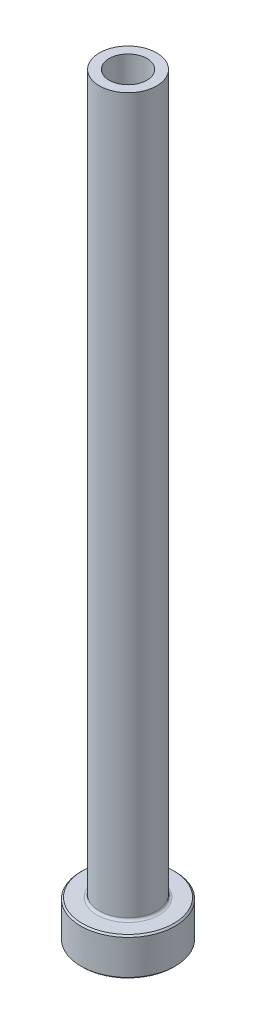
from build123d import *

# Parameters (mm, degrees)
CHAMFER1_SIZE = 0.254


with BuildPart() as part:
    # Sketch1 → Revolve1 (revolve)
    with BuildSketch(Plane.XY, mode=Mode.PRIVATE) as revolve1_sk:
        with BuildLine():
            Line((0, 0), (7.9375, 0))
            Line((7.9375, 0), (7.9375, 6.35))
            Line((7.9375, 6.35), (5.216525, 6.35))
            ThreePointArc((5.216525, 6.35), (4.935891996, 6.466241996), (4.81965, 6.746875))
            Line((4.81965, 6.746875), (4.81965, 127))
            Line((4.81965, 127), (0, 127))
            Line((0, 127), (0, 0))
        make_face()
    revolve(revolve1_sk.sketch.rotate(Axis((0, 0, 0), (0, 1, 0)), 90), axis=Axis((0, 0, 0), (0, 1, 0)))

    # Sketch2 → Cut-Revolve1 (revolve, cut)
    with BuildSketch(Plane.XY, mode=Mode.PRIVATE) as cut_revolve1_sk:
        Polygon((3.762375, 0), (3.3655, 0.396875), (3.3655, 52.5145), (3.175, 66.802), (3.175, 127), (0, 127), (0, 0), align=None)
    revolve(cut_revolve1_sk.sketch.rotate(Axis((0, 0, 0), (0, 1, 0)), 90), axis=Axis((0, 0, 0), (0, 1, 0)), mode=Mode.SUBTRACT)

    # Chamfer1
    chamfer1_edges = [part.edges().sort_by_distance(p)[0] for p in [
        (0, 6.35, 7.9375),
        (0, 0, 7.9375),
    ]]
    chamfer(chamfer1_edges, length=CHAMFER1_SIZE)


solid = part.part
